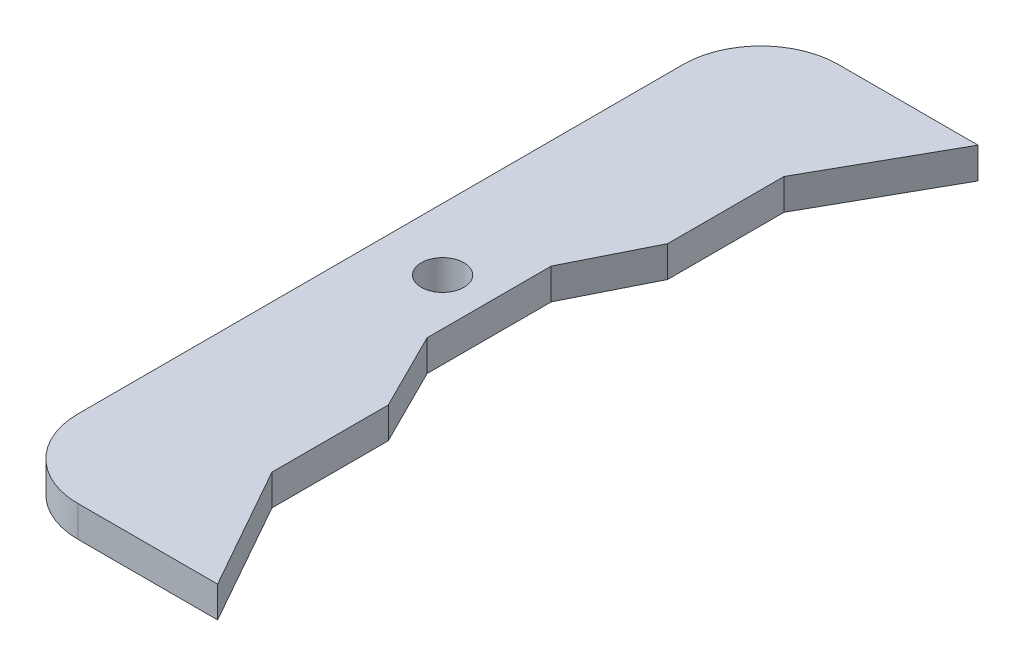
ISO-10303-21;
HEADER;
FILE_DESCRIPTION(('STEP AP214'),'2;1');
FILE_NAME('part.step','',(''),(''),'','','');
FILE_SCHEMA(('AUTOMOTIVE_DESIGN { 1 0 10303 214 1 1 1 1 }'));
ENDSEC;
DATA;
#1=APPLICATION_CONTEXT('core data for automotive mechanical design processes');
#2=APPLICATION_PROTOCOL_DEFINITION('international standard','automotive_design',2000,#1);
#3=PRODUCT_CONTEXT('',#1,'mechanical');
#4=PRODUCT('Part','Part','',(#3));
#5=PRODUCT_RELATED_PRODUCT_CATEGORY('part','',(#4));
#6=PRODUCT_DEFINITION_FORMATION('','',#4);
#7=PRODUCT_DEFINITION_CONTEXT('part definition',#1,'design');
#8=PRODUCT_DEFINITION('design','',#6,#7);
#9=PRODUCT_DEFINITION_SHAPE('','',#8);
#10=(LENGTH_UNIT() NAMED_UNIT(*) SI_UNIT(.MILLI.,.METRE.));
#11=(NAMED_UNIT(*) PLANE_ANGLE_UNIT() SI_UNIT($,.RADIAN.));
#12=(NAMED_UNIT(*) SI_UNIT($,.STERADIAN.) SOLID_ANGLE_UNIT());
#13=UNCERTAINTY_MEASURE_WITH_UNIT(LENGTH_MEASURE(1.E-05),#10,'distance_accuracy_value','');
#14=(GEOMETRIC_REPRESENTATION_CONTEXT(3) GLOBAL_UNCERTAINTY_ASSIGNED_CONTEXT((#13)) GLOBAL_UNIT_ASSIGNED_CONTEXT((#10,
#11,#12)) REPRESENTATION_CONTEXT('',''));
#15=CARTESIAN_POINT('',(0.,0.,0.));
#16=DIRECTION('',(0.,0.,1.));
#17=DIRECTION('',(1.,0.,0.));
#18=AXIS2_PLACEMENT_3D('',#15,#16,#17);
#19=CARTESIAN_POINT('',(10.,4.,-10.));
#20=DIRECTION('',(0.,-1.,0.));
#21=DIRECTION('',(0.,0.,-1.));
#22=AXIS2_PLACEMENT_3D('',#19,#20,#21);
#23=PLANE('',#22);
#24=DIRECTION('',(0.490261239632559,0.,-0.871575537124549));
#25=VECTOR('',#24,1.);
#26=CARTESIAN_POINT('',(28.,4.,-98.));
#27=LINE('',#26,#25);
#28=CARTESIAN_POINT('',(19.,4.,-82.));
#29=VERTEX_POINT('',#28);
#30=CARTESIAN_POINT('',(28.,4.,-98.));
#31=VERTEX_POINT('',#30);
#32=EDGE_CURVE('E175',#29,#31,#27,.T.);
#33=ORIENTED_EDGE('',*,*,#32,.T.);
#34=DIRECTION('',(-1.,0.,0.));
#35=VECTOR('',#34,1.);
#36=CARTESIAN_POINT('',(10.,4.,-98.));
#37=LINE('',#36,#35);
#38=CARTESIAN_POINT('',(10.,4.,-98.));
#39=VERTEX_POINT('',#38);
#40=EDGE_CURVE('E103',#31,#39,#37,.T.);
#41=ORIENTED_EDGE('',*,*,#40,.T.);
#42=CARTESIAN_POINT('',(10.,4.,-88.));
#43=DIRECTION('',(0.,1.,0.));
#44=DIRECTION('',(0.,0.,-1.));
#45=AXIS2_PLACEMENT_3D('',#42,#43,#44);
#46=CIRCLE('',#45,10.);
#47=CARTESIAN_POINT('',(0.,4.,-88.));
#48=VERTEX_POINT('',#47);
#49=EDGE_CURVE('E202',#39,#48,#46,.T.);
#50=ORIENTED_EDGE('',*,*,#49,.T.);
#51=DIRECTION('',(0.,0.,1.));
#52=VECTOR('',#51,1.);
#53=CARTESIAN_POINT('',(0.,4.,-10.0000000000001));
#54=LINE('',#53,#52);
#55=CARTESIAN_POINT('',(0.,4.,-10.0000000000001));
#56=VERTEX_POINT('',#55);
#57=EDGE_CURVE('E221',#48,#56,#54,.T.);
#58=ORIENTED_EDGE('',*,*,#57,.T.);
#59=CARTESIAN_POINT('',(10.,4.,-10.));
#60=DIRECTION('',(0.,1.,0.));
#61=DIRECTION('',(0.,0.,-1.));
#62=AXIS2_PLACEMENT_3D('',#59,#60,#61);
#63=CIRCLE('',#62,10.);
#64=CARTESIAN_POINT('',(10.0000000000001,4.,0.));
#65=VERTEX_POINT('',#64);
#66=EDGE_CURVE('E218',#56,#65,#63,.T.);
#67=ORIENTED_EDGE('',*,*,#66,.T.);
#68=DIRECTION('',(1.,0.,0.));
#69=VECTOR('',#68,1.);
#70=CARTESIAN_POINT('',(10.0000000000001,4.,0.));
#71=LINE('',#70,#69);
#72=CARTESIAN_POINT('',(28.,4.,0.));
#73=VERTEX_POINT('',#72);
#74=EDGE_CURVE('E220',#65,#73,#71,.T.);
#75=ORIENTED_EDGE('',*,*,#74,.T.);
#76=DIRECTION('',(-0.490261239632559,0.,-0.871575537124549));
#77=VECTOR('',#76,1.);
#78=CARTESIAN_POINT('',(28.,4.,0.));
#79=LINE('',#78,#77);
#80=CARTESIAN_POINT('',(19.,4.,-16.));
#81=VERTEX_POINT('',#80);
#82=EDGE_CURVE('E223',#73,#81,#79,.T.);
#83=ORIENTED_EDGE('',*,*,#82,.T.);
#84=DIRECTION('',(0.,0.,-1.));
#85=VECTOR('',#84,1.);
#86=CARTESIAN_POINT('',(19.,4.,-16.));
#87=LINE('',#86,#85);
#88=CARTESIAN_POINT('',(19.,4.,-31.));
#89=VERTEX_POINT('',#88);
#90=EDGE_CURVE('E229',#81,#89,#87,.T.);
#91=ORIENTED_EDGE('',*,*,#90,.T.);
#92=DIRECTION('',(-0.447213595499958,0.,-0.894427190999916));
#93=VECTOR('',#92,1.);
#94=CARTESIAN_POINT('',(19.,4.,-31.));
#95=LINE('',#94,#93);
#96=CARTESIAN_POINT('',(14.,4.,-41.));
#97=VERTEX_POINT('',#96);
#98=EDGE_CURVE('E134',#89,#97,#95,.T.);
#99=ORIENTED_EDGE('',*,*,#98,.T.);
#100=DIRECTION('',(0.,0.,-1.));
#101=VECTOR('',#100,1.);
#102=CARTESIAN_POINT('',(14.,4.,-57.));
#103=LINE('',#102,#101);
#104=CARTESIAN_POINT('',(14.,4.,-57.));
#105=VERTEX_POINT('',#104);
#106=EDGE_CURVE('E128',#97,#105,#103,.T.);
#107=ORIENTED_EDGE('',*,*,#106,.T.);
#108=DIRECTION('',(0.447213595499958,0.,-0.894427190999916));
#109=VECTOR('',#108,1.);
#110=CARTESIAN_POINT('',(19.,4.,-67.));
#111=LINE('',#110,#109);
#112=CARTESIAN_POINT('',(19.,4.,-67.));
#113=VERTEX_POINT('',#112);
#114=EDGE_CURVE('E132',#105,#113,#111,.T.);
#115=ORIENTED_EDGE('',*,*,#114,.T.);
#116=DIRECTION('',(0.,0.,-1.));
#117=VECTOR('',#116,1.);
#118=CARTESIAN_POINT('',(19.,4.,-82.));
#119=LINE('',#118,#117);
#120=EDGE_CURVE('E48',#113,#29,#119,.T.);
#121=ORIENTED_EDGE('',*,*,#120,.T.);
#122=EDGE_LOOP('',(#33,#41,#50,#58,#67,#75,#83,#91,#99,#107,#115,#121));
#123=FACE_BOUND('',#122,.T.);
#124=CARTESIAN_POINT('',(8.,4.,-49.));
#125=DIRECTION('',(0.,1.,0.));
#126=DIRECTION('',(0.,0.,1.));
#127=AXIS2_PLACEMENT_3D('',#124,#125,#126);
#128=CIRCLE('',#127,2.75);
#129=CARTESIAN_POINT('',(8.,4.,-46.25));
#130=VERTEX_POINT('',#129);
#131=EDGE_CURVE('E156',#130,#130,#128,.T.);
#132=ORIENTED_EDGE('',*,*,#131,.F.);
#133=EDGE_LOOP('',(#132));
#134=FACE_BOUND('',#133,.T.);
#135=ADVANCED_FACE('F31',(#123,#134),#23,.F.);
#136=CARTESIAN_POINT('',(10.,0.,-10.));
#137=DIRECTION('',(0.,-1.,0.));
#138=DIRECTION('',(0.,0.,-1.));
#139=AXIS2_PLACEMENT_3D('',#136,#137,#138);
#140=PLANE('',#139);
#141=DIRECTION('',(0.490261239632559,0.,-0.871575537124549));
#142=VECTOR('',#141,1.);
#143=CARTESIAN_POINT('',(28.,0.,-98.));
#144=LINE('',#143,#142);
#145=CARTESIAN_POINT('',(19.,0.,-82.));
#146=VERTEX_POINT('',#145);
#147=CARTESIAN_POINT('',(28.,0.,-98.));
#148=VERTEX_POINT('',#147);
#149=EDGE_CURVE('E152',#146,#148,#144,.T.);
#150=ORIENTED_EDGE('',*,*,#149,.F.);
#151=DIRECTION('',(0.,0.,-1.));
#152=VECTOR('',#151,1.);
#153=CARTESIAN_POINT('',(19.,0.,-82.));
#154=LINE('',#153,#152);
#155=CARTESIAN_POINT('',(19.,0.,-67.));
#156=VERTEX_POINT('',#155);
#157=EDGE_CURVE('E95',#156,#146,#154,.T.);
#158=ORIENTED_EDGE('',*,*,#157,.F.);
#159=DIRECTION('',(0.447213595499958,0.,-0.894427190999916));
#160=VECTOR('',#159,1.);
#161=CARTESIAN_POINT('',(19.,0.,-67.));
#162=LINE('',#161,#160);
#163=CARTESIAN_POINT('',(14.,0.,-57.));
#164=VERTEX_POINT('',#163);
#165=EDGE_CURVE('E89',#164,#156,#162,.T.);
#166=ORIENTED_EDGE('',*,*,#165,.F.);
#167=DIRECTION('',(0.,0.,-1.));
#168=VECTOR('',#167,1.);
#169=CARTESIAN_POINT('',(14.,0.,-57.));
#170=LINE('',#169,#168);
#171=CARTESIAN_POINT('',(14.,0.,-41.));
#172=VERTEX_POINT('',#171);
#173=EDGE_CURVE('E142',#172,#164,#170,.T.);
#174=ORIENTED_EDGE('',*,*,#173,.F.);
#175=DIRECTION('',(-0.447213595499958,0.,-0.894427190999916));
#176=VECTOR('',#175,1.);
#177=CARTESIAN_POINT('',(19.,0.,-31.));
#178=LINE('',#177,#176);
#179=CARTESIAN_POINT('',(19.,0.,-31.));
#180=VERTEX_POINT('',#179);
#181=EDGE_CURVE('E170',#180,#172,#178,.T.);
#182=ORIENTED_EDGE('',*,*,#181,.F.);
#183=DIRECTION('',(0.,0.,-1.));
#184=VECTOR('',#183,1.);
#185=CARTESIAN_POINT('',(19.,0.,-16.));
#186=LINE('',#185,#184);
#187=CARTESIAN_POINT('',(19.,0.,-16.));
#188=VERTEX_POINT('',#187);
#189=EDGE_CURVE('E168',#188,#180,#186,.T.);
#190=ORIENTED_EDGE('',*,*,#189,.F.);
#191=DIRECTION('',(-0.490261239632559,0.,-0.871575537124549));
#192=VECTOR('',#191,1.);
#193=CARTESIAN_POINT('',(28.,0.,0.));
#194=LINE('',#193,#192);
#195=CARTESIAN_POINT('',(28.,0.,0.));
#196=VERTEX_POINT('',#195);
#197=EDGE_CURVE('E166',#196,#188,#194,.T.);
#198=ORIENTED_EDGE('',*,*,#197,.F.);
#199=DIRECTION('',(1.,0.,0.));
#200=VECTOR('',#199,1.);
#201=CARTESIAN_POINT('',(10.0000000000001,0.,0.));
#202=LINE('',#201,#200);
#203=CARTESIAN_POINT('',(10.0000000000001,0.,0.));
#204=VERTEX_POINT('',#203);
#205=EDGE_CURVE('E164',#204,#196,#202,.T.);
#206=ORIENTED_EDGE('',*,*,#205,.F.);
#207=CARTESIAN_POINT('',(10.,0.,-10.));
#208=DIRECTION('',(0.,1.,0.));
#209=DIRECTION('',(0.,0.,-1.));
#210=AXIS2_PLACEMENT_3D('',#207,#208,#209);
#211=CIRCLE('',#210,10.);
#212=CARTESIAN_POINT('',(0.,0.,-10.0000000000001));
#213=VERTEX_POINT('',#212);
#214=EDGE_CURVE('E162',#213,#204,#211,.T.);
#215=ORIENTED_EDGE('',*,*,#214,.F.);
#216=DIRECTION('',(0.,0.,1.));
#217=VECTOR('',#216,1.);
#218=CARTESIAN_POINT('',(0.,0.,-10.0000000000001));
#219=LINE('',#218,#217);
#220=CARTESIAN_POINT('',(0.,0.,-88.));
#221=VERTEX_POINT('',#220);
#222=EDGE_CURVE('E160',#221,#213,#219,.T.);
#223=ORIENTED_EDGE('',*,*,#222,.F.);
#224=CARTESIAN_POINT('',(10.,0.,-88.));
#225=DIRECTION('',(0.,1.,0.));
#226=DIRECTION('',(0.,0.,-1.));
#227=AXIS2_PLACEMENT_3D('',#224,#225,#226);
#228=CIRCLE('',#227,10.);
#229=CARTESIAN_POINT('',(10.,0.,-98.));
#230=VERTEX_POINT('',#229);
#231=EDGE_CURVE('E158',#230,#221,#228,.T.);
#232=ORIENTED_EDGE('',*,*,#231,.F.);
#233=DIRECTION('',(-1.,0.,0.));
#234=VECTOR('',#233,1.);
#235=CARTESIAN_POINT('',(10.,0.,-98.));
#236=LINE('',#235,#234);
#237=EDGE_CURVE('E155',#148,#230,#236,.T.);
#238=ORIENTED_EDGE('',*,*,#237,.F.);
#239=EDGE_LOOP('',(#150,#158,#166,#174,#182,#190,#198,#206,#215,#223,#232,#238));
#240=FACE_BOUND('',#239,.T.);
#241=CARTESIAN_POINT('',(8.,0.,-49.));
#242=DIRECTION('',(0.,1.,0.));
#243=DIRECTION('',(0.,0.,1.));
#244=AXIS2_PLACEMENT_3D('',#241,#242,#243);
#245=CIRCLE('',#244,2.75);
#246=CARTESIAN_POINT('',(8.,0.,-46.25));
#247=VERTEX_POINT('',#246);
#248=EDGE_CURVE('E376',#247,#247,#245,.T.);
#249=ORIENTED_EDGE('',*,*,#248,.T.);
#250=EDGE_LOOP('',(#249));
#251=FACE_BOUND('',#250,.T.);
#252=ADVANCED_FACE('F206',(#240,#251),#140,.T.);
#253=CARTESIAN_POINT('',(28.,4.,-98.));
#254=DIRECTION('',(-0.871575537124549,0.,-0.490261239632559));
#255=DIRECTION('',(-0.490261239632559,0.,0.871575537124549));
#256=AXIS2_PLACEMENT_3D('',#253,#254,#255);
#257=PLANE('',#256);
#258=ORIENTED_EDGE('',*,*,#149,.T.);
#259=DIRECTION('',(0.,-1.,0.));
#260=VECTOR('',#259,1.);
#261=CARTESIAN_POINT('',(28.,4.,-98.));
#262=LINE('',#261,#260);
#263=EDGE_CURVE('E11',#31,#148,#262,.T.);
#264=ORIENTED_EDGE('',*,*,#263,.F.);
#265=ORIENTED_EDGE('',*,*,#32,.F.);
#266=DIRECTION('',(0.,-1.,0.));
#267=VECTOR('',#266,1.);
#268=CARTESIAN_POINT('',(19.,4.,-82.));
#269=LINE('',#268,#267);
#270=EDGE_CURVE('E148',#29,#146,#269,.T.);
#271=ORIENTED_EDGE('',*,*,#270,.T.);
#272=EDGE_LOOP('',(#258,#264,#265,#271));
#273=FACE_BOUND('',#272,.T.);
#274=ADVANCED_FACE('F33',(#273),#257,.F.);
#275=CARTESIAN_POINT('',(10.,4.,-98.));
#276=DIRECTION('',(0.,0.,1.));
#277=DIRECTION('',(1.,0.,0.));
#278=AXIS2_PLACEMENT_3D('',#275,#276,#277);
#279=PLANE('',#278);
#280=ORIENTED_EDGE('',*,*,#237,.T.);
#281=DIRECTION('',(0.,-1.,0.));
#282=VECTOR('',#281,1.);
#283=CARTESIAN_POINT('',(10.,4.,-98.));
#284=LINE('',#283,#282);
#285=EDGE_CURVE('E40',#39,#230,#284,.T.);
#286=ORIENTED_EDGE('',*,*,#285,.F.);
#287=ORIENTED_EDGE('',*,*,#40,.F.);
#288=ORIENTED_EDGE('',*,*,#263,.T.);
#289=EDGE_LOOP('',(#280,#286,#287,#288));
#290=FACE_BOUND('',#289,.T.);
#291=ADVANCED_FACE('F263',(#290),#279,.F.);
#292=CARTESIAN_POINT('',(10.,4.,-88.));
#293=DIRECTION('',(0.,-1.,0.));
#294=DIRECTION('',(0.,0.,-1.));
#295=AXIS2_PLACEMENT_3D('',#292,#293,#294);
#296=CYLINDRICAL_SURFACE('',#295,10.);
#297=ORIENTED_EDGE('',*,*,#231,.T.);
#298=DIRECTION('',(0.,-1.,0.));
#299=VECTOR('',#298,1.);
#300=CARTESIAN_POINT('',(0.,4.,-88.));
#301=LINE('',#300,#299);
#302=EDGE_CURVE('E194',#48,#221,#301,.T.);
#303=ORIENTED_EDGE('',*,*,#302,.F.);
#304=ORIENTED_EDGE('',*,*,#49,.F.);
#305=ORIENTED_EDGE('',*,*,#285,.T.);
#306=EDGE_LOOP('',(#297,#303,#304,#305));
#307=FACE_BOUND('',#306,.T.);
#308=ADVANCED_FACE('F200',(#307),#296,.T.);
#309=CARTESIAN_POINT('',(0.,4.,-10.0000000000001));
#310=DIRECTION('',(1.,0.,0.));
#311=DIRECTION('',(0.,0.,-1.));
#312=AXIS2_PLACEMENT_3D('',#309,#310,#311);
#313=PLANE('',#312);
#314=ORIENTED_EDGE('',*,*,#222,.T.);
#315=DIRECTION('',(0.,-1.,0.));
#316=VECTOR('',#315,1.);
#317=CARTESIAN_POINT('',(0.,4.,-10.0000000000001));
#318=LINE('',#317,#316);
#319=EDGE_CURVE('E191',#56,#213,#318,.T.);
#320=ORIENTED_EDGE('',*,*,#319,.F.);
#321=ORIENTED_EDGE('',*,*,#57,.F.);
#322=ORIENTED_EDGE('',*,*,#302,.T.);
#323=EDGE_LOOP('',(#314,#320,#321,#322));
#324=FACE_BOUND('',#323,.T.);
#325=ADVANCED_FACE('F212',(#324),#313,.F.);
#326=CARTESIAN_POINT('',(10.,4.,-10.));
#327=DIRECTION('',(0.,-1.,0.));
#328=DIRECTION('',(0.,0.,-1.));
#329=AXIS2_PLACEMENT_3D('',#326,#327,#328);
#330=CYLINDRICAL_SURFACE('',#329,10.);
#331=ORIENTED_EDGE('',*,*,#214,.T.);
#332=DIRECTION('',(0.,-1.,0.));
#333=VECTOR('',#332,1.);
#334=CARTESIAN_POINT('',(10.0000000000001,4.,0.));
#335=LINE('',#334,#333);
#336=EDGE_CURVE('E188',#65,#204,#335,.T.);
#337=ORIENTED_EDGE('',*,*,#336,.F.);
#338=ORIENTED_EDGE('',*,*,#66,.F.);
#339=ORIENTED_EDGE('',*,*,#319,.T.);
#340=EDGE_LOOP('',(#331,#337,#338,#339));
#341=FACE_BOUND('',#340,.T.);
#342=ADVANCED_FACE('F216',(#341),#330,.T.);
#343=CARTESIAN_POINT('',(10.0000000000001,4.,0.));
#344=DIRECTION('',(0.,0.,-1.));
#345=DIRECTION('',(-1.,0.,0.));
#346=AXIS2_PLACEMENT_3D('',#343,#344,#345);
#347=PLANE('',#346);
#348=ORIENTED_EDGE('',*,*,#205,.T.);
#349=DIRECTION('',(0.,-1.,0.));
#350=VECTOR('',#349,1.);
#351=CARTESIAN_POINT('',(28.,4.,0.));
#352=LINE('',#351,#350);
#353=EDGE_CURVE('E185',#73,#196,#352,.T.);
#354=ORIENTED_EDGE('',*,*,#353,.F.);
#355=ORIENTED_EDGE('',*,*,#74,.F.);
#356=ORIENTED_EDGE('',*,*,#336,.T.);
#357=EDGE_LOOP('',(#348,#354,#355,#356));
#358=FACE_BOUND('',#357,.T.);
#359=ADVANCED_FACE('F276',(#358),#347,.F.);
#360=CARTESIAN_POINT('',(28.,4.,0.));
#361=DIRECTION('',(-0.871575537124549,0.,0.490261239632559));
#362=DIRECTION('',(0.490261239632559,0.,0.871575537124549));
#363=AXIS2_PLACEMENT_3D('',#360,#361,#362);
#364=PLANE('',#363);
#365=ORIENTED_EDGE('',*,*,#197,.T.);
#366=DIRECTION('',(0.,-1.,0.));
#367=VECTOR('',#366,1.);
#368=CARTESIAN_POINT('',(19.,4.,-16.));
#369=LINE('',#368,#367);
#370=EDGE_CURVE('E182',#81,#188,#369,.T.);
#371=ORIENTED_EDGE('',*,*,#370,.F.);
#372=ORIENTED_EDGE('',*,*,#82,.F.);
#373=ORIENTED_EDGE('',*,*,#353,.T.);
#374=EDGE_LOOP('',(#365,#371,#372,#373));
#375=FACE_BOUND('',#374,.T.);
#376=ADVANCED_FACE('F279',(#375),#364,.F.);
#377=CARTESIAN_POINT('',(19.,4.,-16.));
#378=DIRECTION('',(-1.,0.,0.));
#379=DIRECTION('',(0.,0.,1.));
#380=AXIS2_PLACEMENT_3D('',#377,#378,#379);
#381=PLANE('',#380);
#382=ORIENTED_EDGE('',*,*,#189,.T.);
#383=DIRECTION('',(0.,-1.,0.));
#384=VECTOR('',#383,1.);
#385=CARTESIAN_POINT('',(19.,4.,-31.));
#386=LINE('',#385,#384);
#387=EDGE_CURVE('E179',#89,#180,#386,.T.);
#388=ORIENTED_EDGE('',*,*,#387,.F.);
#389=ORIENTED_EDGE('',*,*,#90,.F.);
#390=ORIENTED_EDGE('',*,*,#370,.T.);
#391=EDGE_LOOP('',(#382,#388,#389,#390));
#392=FACE_BOUND('',#391,.T.);
#393=ADVANCED_FACE('F235',(#392),#381,.F.);
#394=CARTESIAN_POINT('',(19.,4.,-31.));
#395=DIRECTION('',(-0.894427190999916,0.,0.447213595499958));
#396=DIRECTION('',(0.447213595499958,0.,0.894427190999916));
#397=AXIS2_PLACEMENT_3D('',#394,#395,#396);
#398=PLANE('',#397);
#399=ORIENTED_EDGE('',*,*,#181,.T.);
#400=DIRECTION('',(0.,-1.,0.));
#401=VECTOR('',#400,1.);
#402=CARTESIAN_POINT('',(14.,4.,-41.));
#403=LINE('',#402,#401);
#404=EDGE_CURVE('E143',#97,#172,#403,.T.);
#405=ORIENTED_EDGE('',*,*,#404,.F.);
#406=ORIENTED_EDGE('',*,*,#98,.F.);
#407=ORIENTED_EDGE('',*,*,#387,.T.);
#408=EDGE_LOOP('',(#399,#405,#406,#407));
#409=FACE_BOUND('',#408,.T.);
#410=ADVANCED_FACE('F239',(#409),#398,.F.);
#411=CARTESIAN_POINT('',(14.,4.,-57.));
#412=DIRECTION('',(-1.,0.,0.));
#413=DIRECTION('',(0.,0.,1.));
#414=AXIS2_PLACEMENT_3D('',#411,#412,#413);
#415=PLANE('',#414);
#416=ORIENTED_EDGE('',*,*,#173,.T.);
#417=DIRECTION('',(0.,-1.,0.));
#418=VECTOR('',#417,1.);
#419=CARTESIAN_POINT('',(14.,4.,-57.));
#420=LINE('',#419,#418);
#421=EDGE_CURVE('E139',#105,#164,#420,.T.);
#422=ORIENTED_EDGE('',*,*,#421,.F.);
#423=ORIENTED_EDGE('',*,*,#106,.F.);
#424=ORIENTED_EDGE('',*,*,#404,.T.);
#425=EDGE_LOOP('',(#416,#422,#423,#424));
#426=FACE_BOUND('',#425,.T.);
#427=ADVANCED_FACE('F140',(#426),#415,.F.);
#428=CARTESIAN_POINT('',(19.,4.,-67.));
#429=DIRECTION('',(-0.894427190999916,0.,-0.447213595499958));
#430=DIRECTION('',(-0.447213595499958,0.,0.894427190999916));
#431=AXIS2_PLACEMENT_3D('',#428,#429,#430);
#432=PLANE('',#431);
#433=ORIENTED_EDGE('',*,*,#165,.T.);
#434=DIRECTION('',(0.,-1.,0.));
#435=VECTOR('',#434,1.);
#436=CARTESIAN_POINT('',(19.,4.,-67.));
#437=LINE('',#436,#435);
#438=EDGE_CURVE('E144',#113,#156,#437,.T.);
#439=ORIENTED_EDGE('',*,*,#438,.F.);
#440=ORIENTED_EDGE('',*,*,#114,.F.);
#441=ORIENTED_EDGE('',*,*,#421,.T.);
#442=EDGE_LOOP('',(#433,#439,#440,#441));
#443=FACE_BOUND('',#442,.T.);
#444=ADVANCED_FACE('F146',(#443),#432,.F.);
#445=CARTESIAN_POINT('',(19.,4.,-82.));
#446=DIRECTION('',(-1.,0.,0.));
#447=DIRECTION('',(0.,0.,1.));
#448=AXIS2_PLACEMENT_3D('',#445,#446,#447);
#449=PLANE('',#448);
#450=ORIENTED_EDGE('',*,*,#157,.T.);
#451=ORIENTED_EDGE('',*,*,#270,.F.);
#452=ORIENTED_EDGE('',*,*,#120,.F.);
#453=ORIENTED_EDGE('',*,*,#438,.T.);
#454=EDGE_LOOP('',(#450,#451,#452,#453));
#455=FACE_BOUND('',#454,.T.);
#456=ADVANCED_FACE('F243',(#455),#449,.F.);
#457=CARTESIAN_POINT('',(8.,4.,-49.));
#458=DIRECTION('',(0.,-1.,0.));
#459=DIRECTION('',(0.,0.,-1.));
#460=AXIS2_PLACEMENT_3D('',#457,#458,#459);
#461=CYLINDRICAL_SURFACE('',#460,2.75);
#462=ORIENTED_EDGE('',*,*,#131,.T.);
#463=EDGE_LOOP('',(#462));
#464=FACE_BOUND('',#463,.T.);
#465=ORIENTED_EDGE('',*,*,#248,.F.);
#466=EDGE_LOOP('',(#465));
#467=FACE_BOUND('',#466,.T.);
#468=ADVANCED_FACE('F245',(#464,#467),#461,.F.);
#469=CLOSED_SHELL('',(#135,#252,#274,#291,#308,#325,#342,#359,#376,#393,#410,#427,#444,#456,#468));
#470=MANIFOLD_SOLID_BREP('B2',#469);
#471=ADVANCED_BREP_SHAPE_REPRESENTATION('',(#18,#470),#14);
#472=SHAPE_DEFINITION_REPRESENTATION(#9,#471);
ENDSEC;
END-ISO-10303-21;
